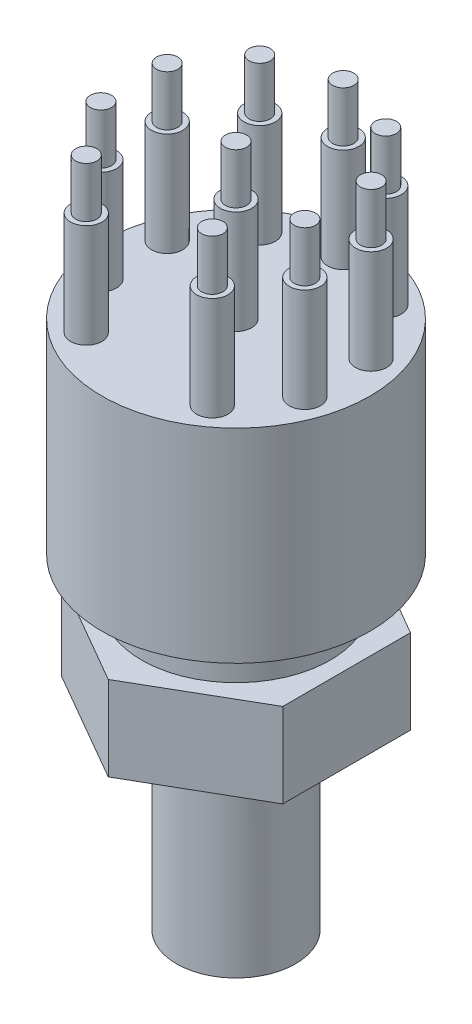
ISO-10303-21;
HEADER;
FILE_DESCRIPTION(('STEP AP214'),'2;1');
FILE_NAME('part.step','',(''),(''),'','','');
FILE_SCHEMA(('AUTOMOTIVE_DESIGN { 1 0 10303 214 1 1 1 1 }'));
ENDSEC;
DATA;
#1=APPLICATION_CONTEXT('core data for automotive mechanical design processes');
#2=APPLICATION_PROTOCOL_DEFINITION('international standard','automotive_design',2000,#1);
#3=PRODUCT_CONTEXT('',#1,'mechanical');
#4=PRODUCT('Part','Part','',(#3));
#5=PRODUCT_RELATED_PRODUCT_CATEGORY('part','',(#4));
#6=PRODUCT_DEFINITION_FORMATION('','',#4);
#7=PRODUCT_DEFINITION_CONTEXT('part definition',#1,'design');
#8=PRODUCT_DEFINITION('design','',#6,#7);
#9=PRODUCT_DEFINITION_SHAPE('','',#8);
#10=(LENGTH_UNIT() NAMED_UNIT(*) SI_UNIT(.MILLI.,.METRE.));
#11=(NAMED_UNIT(*) PLANE_ANGLE_UNIT() SI_UNIT($,.RADIAN.));
#12=(NAMED_UNIT(*) SI_UNIT($,.STERADIAN.) SOLID_ANGLE_UNIT());
#13=UNCERTAINTY_MEASURE_WITH_UNIT(LENGTH_MEASURE(1.E-05),#10,'distance_accuracy_value','');
#14=(GEOMETRIC_REPRESENTATION_CONTEXT(3) GLOBAL_UNCERTAINTY_ASSIGNED_CONTEXT((#13)) GLOBAL_UNIT_ASSIGNED_CONTEXT((#10,
#11,#12)) REPRESENTATION_CONTEXT('',''));
#15=CARTESIAN_POINT('',(0.,0.,0.));
#16=DIRECTION('',(0.,0.,1.));
#17=DIRECTION('',(1.,0.,0.));
#18=AXIS2_PLACEMENT_3D('',#15,#16,#17);
#19=CARTESIAN_POINT('',(-10.32,0.,-17.8747643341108));
#20=DIRECTION('',(0.,1.,0.));
#21=DIRECTION('',(0.,0.,1.));
#22=AXIS2_PLACEMENT_3D('',#19,#20,#21);
#23=PLANE('',#22);
#24=DIRECTION('',(-0.866025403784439,0.,-0.5));
#25=VECTOR('',#24,1.);
#26=CARTESIAN_POINT('',(10.32,0.,-5.95825477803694));
#27=LINE('',#26,#25);
#28=CARTESIAN_POINT('',(10.32,0.,-5.95825477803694));
#29=VERTEX_POINT('',#28);
#30=CARTESIAN_POINT('',(0.,0.,-11.9165095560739));
#31=VERTEX_POINT('',#30);
#32=EDGE_CURVE('E94',#29,#31,#27,.T.);
#33=ORIENTED_EDGE('',*,*,#32,.F.);
#34=DIRECTION('',(0.,0.,-1.));
#35=VECTOR('',#34,1.);
#36=CARTESIAN_POINT('',(10.32,0.,5.95825477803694));
#37=LINE('',#36,#35);
#38=CARTESIAN_POINT('',(10.32,0.,5.95825477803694));
#39=VERTEX_POINT('',#38);
#40=EDGE_CURVE('E124',#39,#29,#37,.T.);
#41=ORIENTED_EDGE('',*,*,#40,.F.);
#42=DIRECTION('',(0.866025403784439,0.,-0.5));
#43=VECTOR('',#42,1.);
#44=CARTESIAN_POINT('',(0.,0.,11.9165095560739));
#45=LINE('',#44,#43);
#46=CARTESIAN_POINT('',(0.,0.,11.9165095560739));
#47=VERTEX_POINT('',#46);
#48=EDGE_CURVE('E122',#47,#39,#45,.T.);
#49=ORIENTED_EDGE('',*,*,#48,.F.);
#50=DIRECTION('',(0.866025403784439,0.,0.5));
#51=VECTOR('',#50,1.);
#52=CARTESIAN_POINT('',(-10.32,0.,5.95825477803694));
#53=LINE('',#52,#51);
#54=CARTESIAN_POINT('',(-10.32,0.,5.95825477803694));
#55=VERTEX_POINT('',#54);
#56=EDGE_CURVE('E120',#55,#47,#53,.T.);
#57=ORIENTED_EDGE('',*,*,#56,.F.);
#58=DIRECTION('',(0.,0.,1.));
#59=VECTOR('',#58,1.);
#60=CARTESIAN_POINT('',(-10.32,0.,-5.95825477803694));
#61=LINE('',#60,#59);
#62=CARTESIAN_POINT('',(-10.32,0.,-5.95825477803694));
#63=VERTEX_POINT('',#62);
#64=EDGE_CURVE('E96',#63,#55,#61,.T.);
#65=ORIENTED_EDGE('',*,*,#64,.F.);
#66=DIRECTION('',(-0.866025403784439,0.,0.5));
#67=VECTOR('',#66,1.);
#68=CARTESIAN_POINT('',(0.,0.,-11.9165095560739));
#69=LINE('',#68,#67);
#70=EDGE_CURVE('E89',#31,#63,#69,.T.);
#71=ORIENTED_EDGE('',*,*,#70,.F.);
#72=EDGE_LOOP('',(#33,#41,#49,#57,#65,#71));
#73=FACE_BOUND('',#72,.T.);
#74=CARTESIAN_POINT('',(0.,0.,0.));
#75=DIRECTION('',(0.,1.,0.));
#76=DIRECTION('',(0.,0.,1.));
#77=AXIS2_PLACEMENT_3D('',#74,#75,#76);
#78=CIRCLE('',#77,8.73336420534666);
#79=CARTESIAN_POINT('',(0.,0.,8.73336420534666));
#80=VERTEX_POINT('',#79);
#81=EDGE_CURVE('E11',#80,#80,#78,.F.);
#82=ORIENTED_EDGE('',*,*,#81,.F.);
#83=EDGE_LOOP('',(#82));
#84=FACE_BOUND('',#83,.T.);
#85=ADVANCED_FACE('F36',(#73,#84),#23,.F.);
#86=CARTESIAN_POINT('',(0.,40.706,0.));
#87=DIRECTION('',(0.,1.,0.));
#88=DIRECTION('',(-1.,0.,0.));
#89=AXIS2_PLACEMENT_3D('',#86,#87,#88);
#90=PLANE('',#89);
#91=CARTESIAN_POINT('',(0.,40.706,0.));
#92=DIRECTION('',(0.,1.,0.));
#93=DIRECTION('',(-1.,0.,0.));
#94=AXIS2_PLACEMENT_3D('',#91,#92,#93);
#95=CIRCLE('',#94,1.4605);
#96=CARTESIAN_POINT('',(-1.46050000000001,40.706,0.));
#97=VERTEX_POINT('',#96);
#98=EDGE_CURVE('E472',#97,#97,#95,.T.);
#99=ORIENTED_EDGE('',*,*,#98,.T.);
#100=EDGE_LOOP('',(#99));
#101=FACE_BOUND('',#100,.T.);
#102=CARTESIAN_POINT('',(0.,40.706,0.));
#103=DIRECTION('',(0.,1.,0.));
#104=DIRECTION('',(-1.,0.,0.));
#105=AXIS2_PLACEMENT_3D('',#102,#103,#104);
#106=CIRCLE('',#105,0.9906);
#107=CARTESIAN_POINT('',(-0.990600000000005,40.706,0.));
#108=VERTEX_POINT('',#107);
#109=EDGE_CURVE('E480',#108,#108,#106,.T.);
#110=ORIENTED_EDGE('',*,*,#109,.F.);
#111=EDGE_LOOP('',(#110));
#112=FACE_BOUND('',#111,.T.);
#113=ADVANCED_FACE('F168',(#101,#112),#90,.T.);
#114=CARTESIAN_POINT('',(0.,31.054,0.));
#115=DIRECTION('',(0.,1.,0.));
#116=DIRECTION('',(-1.,0.,0.));
#117=AXIS2_PLACEMENT_3D('',#114,#115,#116);
#118=PLANE('',#117);
#119=CARTESIAN_POINT('',(-5.87785252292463,31.054,-8.09016994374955));
#120=DIRECTION('',(0.,1.,0.));
#121=DIRECTION('',(-0.809016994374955,0.,0.587785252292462));
#122=AXIS2_PLACEMENT_3D('',#119,#120,#121);
#123=CIRCLE('',#122,1.4605);
#124=CARTESIAN_POINT('',(-7.05942184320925,31.054,-7.23170958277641));
#125=VERTEX_POINT('',#124);
#126=EDGE_CURVE('E469',#125,#125,#123,.T.);
#127=ORIENTED_EDGE('',*,*,#126,.F.);
#128=EDGE_LOOP('',(#127));
#129=FACE_BOUND('',#128,.T.);
#130=CARTESIAN_POINT('',(-9.51056516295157,31.054,3.09016994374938));
#131=DIRECTION('',(0.,1.,0.));
#132=DIRECTION('',(0.309016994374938,0.,0.951056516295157));
#133=AXIS2_PLACEMENT_3D('',#130,#131,#132);
#134=CIRCLE('',#133,1.4605);
#135=CARTESIAN_POINT('',(-9.05924584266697,31.054,4.47918798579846));
#136=VERTEX_POINT('',#135);
#137=EDGE_CURVE('E445',#136,#136,#134,.T.);
#138=ORIENTED_EDGE('',*,*,#137,.F.);
#139=EDGE_LOOP('',(#138));
#140=FACE_BOUND('',#139,.T.);
#141=CARTESIAN_POINT('',(5.87785252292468,31.054,8.09016994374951));
#142=DIRECTION('',(0.,1.,0.));
#143=DIRECTION('',(0.809016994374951,0.,-0.587785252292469));
#144=AXIS2_PLACEMENT_3D('',#141,#142,#143);
#145=CIRCLE('',#144,1.4605);
#146=CARTESIAN_POINT('',(7.0594218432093,31.054,7.23170958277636));
#147=VERTEX_POINT('',#146);
#148=EDGE_CURVE('E421',#147,#147,#145,.T.);
#149=ORIENTED_EDGE('',*,*,#148,.F.);
#150=EDGE_LOOP('',(#149));
#151=FACE_BOUND('',#150,.T.);
#152=CARTESIAN_POINT('',(9.51056516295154,31.054,-3.09016994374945));
#153=DIRECTION('',(0.,1.,0.));
#154=DIRECTION('',(-0.309016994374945,0.,-0.951056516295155));
#155=AXIS2_PLACEMENT_3D('',#152,#153,#154);
#156=CIRCLE('',#155,1.4605);
#157=CARTESIAN_POINT('',(9.05924584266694,31.054,-4.47918798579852));
#158=VERTEX_POINT('',#157);
#159=EDGE_CURVE('E397',#158,#158,#156,.T.);
#160=ORIENTED_EDGE('',*,*,#159,.F.);
#161=EDGE_LOOP('',(#160));
#162=FACE_BOUND('',#161,.T.);
#163=CARTESIAN_POINT('',(0.,31.054,-10.));
#164=DIRECTION('',(0.,1.,0.));
#165=DIRECTION('',(-1.,0.,0.));
#166=AXIS2_PLACEMENT_3D('',#163,#164,#165);
#167=CIRCLE('',#166,1.4605);
#168=CARTESIAN_POINT('',(-1.4605,31.054,-10.));
#169=VERTEX_POINT('',#168);
#170=EDGE_CURVE('E367',#169,#169,#167,.T.);
#171=ORIENTED_EDGE('',*,*,#170,.F.);
#172=EDGE_LOOP('',(#171));
#173=FACE_BOUND('',#172,.T.);
#174=CARTESIAN_POINT('',(0.,31.054,0.));
#175=DIRECTION('',(0.,1.,0.));
#176=DIRECTION('',(-1.,0.,0.));
#177=AXIS2_PLACEMENT_3D('',#174,#175,#176);
#178=CIRCLE('',#177,12.5);
#179=CARTESIAN_POINT('',(-12.5,31.054,0.));
#180=VERTEX_POINT('',#179);
#181=EDGE_CURVE('E357',#180,#180,#178,.T.);
#182=ORIENTED_EDGE('',*,*,#181,.T.);
#183=EDGE_LOOP('',(#182));
#184=FACE_BOUND('',#183,.T.);
#185=CARTESIAN_POINT('',(5.87785252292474,31.054,-8.09016994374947));
#186=DIRECTION('',(0.,1.,0.));
#187=DIRECTION('',(-0.809016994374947,0.,-0.587785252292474));
#188=AXIS2_PLACEMENT_3D('',#185,#186,#187);
#189=CIRCLE('',#188,1.4605);
#190=CARTESIAN_POINT('',(4.69628320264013,31.054,-8.94863030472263));
#191=VERTEX_POINT('',#190);
#192=EDGE_CURVE('E385',#191,#191,#189,.T.);
#193=ORIENTED_EDGE('',*,*,#192,.F.);
#194=EDGE_LOOP('',(#193));
#195=FACE_BOUND('',#194,.T.);
#196=CARTESIAN_POINT('',(9.51056516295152,31.054,3.09016994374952));
#197=DIRECTION('',(0.,1.,0.));
#198=DIRECTION('',(0.309016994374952,0.,-0.951056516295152));
#199=AXIS2_PLACEMENT_3D('',#196,#197,#198);
#200=CIRCLE('',#199,1.4605);
#201=CARTESIAN_POINT('',(9.96188448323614,31.054,1.70115190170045));
#202=VERTEX_POINT('',#201);
#203=EDGE_CURVE('E409',#202,#202,#200,.T.);
#204=ORIENTED_EDGE('',*,*,#203,.F.);
#205=EDGE_LOOP('',(#204));
#206=FACE_BOUND('',#205,.T.);
#207=CARTESIAN_POINT('',(-5.87785252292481,31.054,8.09016994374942));
#208=DIRECTION('',(0.,1.,0.));
#209=DIRECTION('',(0.809016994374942,0.,0.58778525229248));
#210=AXIS2_PLACEMENT_3D('',#207,#208,#209);
#211=CIRCLE('',#210,1.4605);
#212=CARTESIAN_POINT('',(-4.6962832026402,31.054,8.94863030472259));
#213=VERTEX_POINT('',#212);
#214=EDGE_CURVE('E433',#213,#213,#211,.T.);
#215=ORIENTED_EDGE('',*,*,#214,.F.);
#216=EDGE_LOOP('',(#215));
#217=FACE_BOUND('',#216,.T.);
#218=CARTESIAN_POINT('',(-9.5105651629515,31.054,-3.09016994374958));
#219=DIRECTION('',(0.,1.,0.));
#220=DIRECTION('',(-0.309016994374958,0.,0.95105651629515));
#221=AXIS2_PLACEMENT_3D('',#218,#219,#220);
#222=CIRCLE('',#221,1.4605);
#223=CARTESIAN_POINT('',(-9.96188448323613,31.054,-1.70115190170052));
#224=VERTEX_POINT('',#223);
#225=EDGE_CURVE('E457',#224,#224,#222,.T.);
#226=ORIENTED_EDGE('',*,*,#225,.F.);
#227=EDGE_LOOP('',(#226));
#228=FACE_BOUND('',#227,.T.);
#229=CARTESIAN_POINT('',(0.,31.054,0.));
#230=DIRECTION('',(0.,1.,0.));
#231=DIRECTION('',(-1.,0.,0.));
#232=AXIS2_PLACEMENT_3D('',#229,#230,#231);
#233=CIRCLE('',#232,1.4605);
#234=CARTESIAN_POINT('',(-1.4605,31.054,0.));
#235=VERTEX_POINT('',#234);
#236=EDGE_CURVE('E474',#235,#235,#233,.T.);
#237=ORIENTED_EDGE('',*,*,#236,.F.);
#238=EDGE_LOOP('',(#237));
#239=FACE_BOUND('',#238,.T.);
#240=ADVANCED_FACE('F172',(#129,#140,#151,#162,#173,#184,#195,#206,#217,#228,#239),#118,.T.);
#241=CARTESIAN_POINT('',(0.,40.706,-10.));
#242=DIRECTION('',(0.,1.,0.));
#243=DIRECTION('',(-1.,0.,0.));
#244=AXIS2_PLACEMENT_3D('',#241,#242,#243);
#245=PLANE('',#244);
#246=CARTESIAN_POINT('',(0.,40.706,-10.));
#247=DIRECTION('',(0.,1.,0.));
#248=DIRECTION('',(-1.,0.,0.));
#249=AXIS2_PLACEMENT_3D('',#246,#247,#248);
#250=CIRCLE('',#249,1.4605);
#251=CARTESIAN_POINT('',(-1.46050000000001,40.706,-10.));
#252=VERTEX_POINT('',#251);
#253=EDGE_CURVE('E364',#252,#252,#250,.T.);
#254=ORIENTED_EDGE('',*,*,#253,.T.);
#255=EDGE_LOOP('',(#254));
#256=FACE_BOUND('',#255,.T.);
#257=CARTESIAN_POINT('',(0.,40.706,-10.));
#258=DIRECTION('',(0.,1.,0.));
#259=DIRECTION('',(-1.,0.,0.));
#260=AXIS2_PLACEMENT_3D('',#257,#258,#259);
#261=CIRCLE('',#260,0.9906);
#262=CARTESIAN_POINT('',(-0.990600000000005,40.706,-10.));
#263=VERTEX_POINT('',#262);
#264=EDGE_CURVE('E373',#263,#263,#261,.T.);
#265=ORIENTED_EDGE('',*,*,#264,.F.);
#266=EDGE_LOOP('',(#265));
#267=FACE_BOUND('',#266,.T.);
#268=ADVANCED_FACE('F178',(#256,#267),#245,.T.);
#269=CARTESIAN_POINT('',(-10.32,7.874,-17.8747643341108));
#270=DIRECTION('',(0.,1.,0.));
#271=DIRECTION('',(0.,0.,1.));
#272=AXIS2_PLACEMENT_3D('',#269,#270,#271);
#273=PLANE('',#272);
#274=DIRECTION('',(-0.866025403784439,0.,-0.5));
#275=VECTOR('',#274,1.);
#276=CARTESIAN_POINT('',(10.32,7.874,-5.95825477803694));
#277=LINE('',#276,#275);
#278=CARTESIAN_POINT('',(10.32,7.874,-5.95825477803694));
#279=VERTEX_POINT('',#278);
#280=CARTESIAN_POINT('',(0.,7.874,-11.9165095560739));
#281=VERTEX_POINT('',#280);
#282=EDGE_CURVE('E126',#279,#281,#277,.T.);
#283=ORIENTED_EDGE('',*,*,#282,.T.);
#284=DIRECTION('',(-0.866025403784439,0.,0.5));
#285=VECTOR('',#284,1.);
#286=CARTESIAN_POINT('',(0.,7.874,-11.9165095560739));
#287=LINE('',#286,#285);
#288=CARTESIAN_POINT('',(-10.32,7.874,-5.95825477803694));
#289=VERTEX_POINT('',#288);
#290=EDGE_CURVE('E104',#281,#289,#287,.T.);
#291=ORIENTED_EDGE('',*,*,#290,.T.);
#292=DIRECTION('',(0.,0.,1.));
#293=VECTOR('',#292,1.);
#294=CARTESIAN_POINT('',(-10.32,7.874,-5.95825477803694));
#295=LINE('',#294,#293);
#296=CARTESIAN_POINT('',(-10.32,7.874,5.95825477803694));
#297=VERTEX_POINT('',#296);
#298=EDGE_CURVE('E129',#289,#297,#295,.T.);
#299=ORIENTED_EDGE('',*,*,#298,.T.);
#300=DIRECTION('',(0.866025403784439,0.,0.5));
#301=VECTOR('',#300,1.);
#302=CARTESIAN_POINT('',(-10.32,7.874,5.95825477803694));
#303=LINE('',#302,#301);
#304=CARTESIAN_POINT('',(0.,7.874,11.9165095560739));
#305=VERTEX_POINT('',#304);
#306=EDGE_CURVE('E131',#297,#305,#303,.T.);
#307=ORIENTED_EDGE('',*,*,#306,.T.);
#308=DIRECTION('',(0.866025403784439,0.,-0.5));
#309=VECTOR('',#308,1.);
#310=CARTESIAN_POINT('',(0.,7.874,11.9165095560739));
#311=LINE('',#310,#309);
#312=CARTESIAN_POINT('',(10.32,7.874,5.95825477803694));
#313=VERTEX_POINT('',#312);
#314=EDGE_CURVE('E56',#305,#313,#311,.T.);
#315=ORIENTED_EDGE('',*,*,#314,.T.);
#316=DIRECTION('',(0.,0.,-1.));
#317=VECTOR('',#316,1.);
#318=CARTESIAN_POINT('',(10.32,7.874,5.95825477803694));
#319=LINE('',#318,#317);
#320=EDGE_CURVE('E51',#313,#279,#319,.T.);
#321=ORIENTED_EDGE('',*,*,#320,.T.);
#322=EDGE_LOOP('',(#283,#291,#299,#307,#315,#321));
#323=FACE_BOUND('',#322,.T.);
#324=CARTESIAN_POINT('',(0.,7.874,0.));
#325=DIRECTION('',(0.,1.,0.));
#326=DIRECTION('',(-1.,0.,0.));
#327=AXIS2_PLACEMENT_3D('',#324,#325,#326);
#328=CIRCLE('',#327,8.8011);
#329=CARTESIAN_POINT('',(-8.8011,7.874,0.));
#330=VERTEX_POINT('',#329);
#331=EDGE_CURVE('E115',#330,#330,#328,.T.);
#332=ORIENTED_EDGE('',*,*,#331,.F.);
#333=EDGE_LOOP('',(#332));
#334=FACE_BOUND('',#333,.T.);
#335=ADVANCED_FACE('F330',(#323,#334),#273,.T.);
#336=CARTESIAN_POINT('',(10.32,7.874,-5.95825477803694));
#337=DIRECTION('',(-0.5,0.,0.866025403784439));
#338=DIRECTION('',(0.866025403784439,0.,0.5));
#339=AXIS2_PLACEMENT_3D('',#336,#337,#338);
#340=PLANE('',#339);
#341=ORIENTED_EDGE('',*,*,#32,.T.);
#342=DIRECTION('',(0.,-1.,0.));
#343=VECTOR('',#342,1.);
#344=CARTESIAN_POINT('',(0.,7.874,-11.9165095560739));
#345=LINE('',#344,#343);
#346=EDGE_CURVE('E102',#281,#31,#345,.T.);
#347=ORIENTED_EDGE('',*,*,#346,.F.);
#348=ORIENTED_EDGE('',*,*,#282,.F.);
#349=DIRECTION('',(0.,-1.,0.));
#350=VECTOR('',#349,1.);
#351=CARTESIAN_POINT('',(10.32,7.874,-5.95825477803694));
#352=LINE('',#351,#350);
#353=EDGE_CURVE('E111',#279,#29,#352,.T.);
#354=ORIENTED_EDGE('',*,*,#353,.T.);
#355=EDGE_LOOP('',(#341,#347,#348,#354));
#356=FACE_BOUND('',#355,.T.);
#357=ADVANCED_FACE('F38',(#356),#340,.F.);
#358=CARTESIAN_POINT('',(0.,7.874,-11.9165095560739));
#359=DIRECTION('',(0.5,0.,0.866025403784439));
#360=DIRECTION('',(0.866025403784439,0.,-0.5));
#361=AXIS2_PLACEMENT_3D('',#358,#359,#360);
#362=PLANE('',#361);
#363=ORIENTED_EDGE('',*,*,#70,.T.);
#364=DIRECTION('',(0.,-1.,0.));
#365=VECTOR('',#364,1.);
#366=CARTESIAN_POINT('',(-10.32,7.874,-5.95825477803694));
#367=LINE('',#366,#365);
#368=EDGE_CURVE('E108',#289,#63,#367,.T.);
#369=ORIENTED_EDGE('',*,*,#368,.F.);
#370=ORIENTED_EDGE('',*,*,#290,.F.);
#371=ORIENTED_EDGE('',*,*,#346,.T.);
#372=EDGE_LOOP('',(#363,#369,#370,#371));
#373=FACE_BOUND('',#372,.T.);
#374=ADVANCED_FACE('F103',(#373),#362,.F.);
#375=CARTESIAN_POINT('',(-10.32,7.874,-5.95825477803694));
#376=DIRECTION('',(1.,0.,0.));
#377=DIRECTION('',(0.,0.,-1.));
#378=AXIS2_PLACEMENT_3D('',#375,#376,#377);
#379=PLANE('',#378);
#380=ORIENTED_EDGE('',*,*,#64,.T.);
#381=DIRECTION('',(0.,-1.,0.));
#382=VECTOR('',#381,1.);
#383=CARTESIAN_POINT('',(-10.32,7.874,5.95825477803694));
#384=LINE('',#383,#382);
#385=EDGE_CURVE('E142',#297,#55,#384,.T.);
#386=ORIENTED_EDGE('',*,*,#385,.F.);
#387=ORIENTED_EDGE('',*,*,#298,.F.);
#388=ORIENTED_EDGE('',*,*,#368,.T.);
#389=EDGE_LOOP('',(#380,#386,#387,#388));
#390=FACE_BOUND('',#389,.T.);
#391=ADVANCED_FACE('F698',(#390),#379,.F.);
#392=CARTESIAN_POINT('',(-10.32,7.874,5.95825477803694));
#393=DIRECTION('',(0.5,0.,-0.866025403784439));
#394=DIRECTION('',(-0.866025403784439,0.,-0.5));
#395=AXIS2_PLACEMENT_3D('',#392,#393,#394);
#396=PLANE('',#395);
#397=ORIENTED_EDGE('',*,*,#56,.T.);
#398=DIRECTION('',(0.,-1.,0.));
#399=VECTOR('',#398,1.);
#400=CARTESIAN_POINT('',(0.,7.874,11.9165095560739));
#401=LINE('',#400,#399);
#402=EDGE_CURVE('E139',#305,#47,#401,.T.);
#403=ORIENTED_EDGE('',*,*,#402,.F.);
#404=ORIENTED_EDGE('',*,*,#306,.F.);
#405=ORIENTED_EDGE('',*,*,#385,.T.);
#406=EDGE_LOOP('',(#397,#403,#404,#405));
#407=FACE_BOUND('',#406,.T.);
#408=ADVANCED_FACE('F688',(#407),#396,.F.);
#409=CARTESIAN_POINT('',(0.,7.874,11.9165095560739));
#410=DIRECTION('',(-0.5,0.,-0.866025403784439));
#411=DIRECTION('',(-0.866025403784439,0.,0.5));
#412=AXIS2_PLACEMENT_3D('',#409,#410,#411);
#413=PLANE('',#412);
#414=ORIENTED_EDGE('',*,*,#48,.T.);
#415=DIRECTION('',(0.,-1.,0.));
#416=VECTOR('',#415,1.);
#417=CARTESIAN_POINT('',(10.32,7.874,5.95825477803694));
#418=LINE('',#417,#416);
#419=EDGE_CURVE('E136',#313,#39,#418,.T.);
#420=ORIENTED_EDGE('',*,*,#419,.F.);
#421=ORIENTED_EDGE('',*,*,#314,.F.);
#422=ORIENTED_EDGE('',*,*,#402,.T.);
#423=EDGE_LOOP('',(#414,#420,#421,#422));
#424=FACE_BOUND('',#423,.T.);
#425=ADVANCED_FACE('F349',(#424),#413,.F.);
#426=CARTESIAN_POINT('',(10.32,7.874,5.95825477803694));
#427=DIRECTION('',(-1.,0.,0.));
#428=DIRECTION('',(0.,0.,1.));
#429=AXIS2_PLACEMENT_3D('',#426,#427,#428);
#430=PLANE('',#429);
#431=ORIENTED_EDGE('',*,*,#40,.T.);
#432=ORIENTED_EDGE('',*,*,#353,.F.);
#433=ORIENTED_EDGE('',*,*,#320,.F.);
#434=ORIENTED_EDGE('',*,*,#419,.T.);
#435=EDGE_LOOP('',(#431,#432,#433,#434));
#436=FACE_BOUND('',#435,.T.);
#437=ADVANCED_FACE('F344',(#436),#430,.F.);
#438=CARTESIAN_POINT('',(0.,0.,0.));
#439=DIRECTION('',(0.,1.,0.));
#440=DIRECTION('',(-1.,0.,0.));
#441=AXIS2_PLACEMENT_3D('',#438,#439,#440);
#442=CYLINDRICAL_SURFACE('',#441,8.8011);
#443=CARTESIAN_POINT('',(0.,12.054,0.));
#444=DIRECTION('',(0.,1.,0.));
#445=DIRECTION('',(-1.,0.,0.));
#446=AXIS2_PLACEMENT_3D('',#443,#444,#445);
#447=CIRCLE('',#446,8.8011);
#448=CARTESIAN_POINT('',(-8.8011,12.054,0.));
#449=VERTEX_POINT('',#448);
#450=EDGE_CURVE('E112',#449,#449,#447,.T.);
#451=ORIENTED_EDGE('',*,*,#450,.F.);
#452=EDGE_LOOP('',(#451));
#453=FACE_BOUND('',#452,.T.);
#454=ORIENTED_EDGE('',*,*,#331,.T.);
#455=EDGE_LOOP('',(#454));
#456=FACE_BOUND('',#455,.T.);
#457=ADVANCED_FACE('F338',(#453,#456),#442,.T.);
#458=CARTESIAN_POINT('',(0.,12.054,0.));
#459=DIRECTION('',(0.,1.,0.));
#460=DIRECTION('',(-1.,0.,0.));
#461=AXIS2_PLACEMENT_3D('',#458,#459,#460);
#462=PLANE('',#461);
#463=CARTESIAN_POINT('',(0.,12.054,0.));
#464=DIRECTION('',(0.,1.,0.));
#465=DIRECTION('',(-1.,0.,0.));
#466=AXIS2_PLACEMENT_3D('',#463,#464,#465);
#467=CIRCLE('',#466,12.5);
#468=CARTESIAN_POINT('',(-12.5,12.054,0.));
#469=VERTEX_POINT('',#468);
#470=EDGE_CURVE('E359',#469,#469,#467,.T.);
#471=ORIENTED_EDGE('',*,*,#470,.F.);
#472=EDGE_LOOP('',(#471));
#473=FACE_BOUND('',#472,.T.);
#474=ORIENTED_EDGE('',*,*,#450,.T.);
#475=EDGE_LOOP('',(#474));
#476=FACE_BOUND('',#475,.T.);
#477=ADVANCED_FACE('F336',(#473,#476),#462,.F.);
#478=CARTESIAN_POINT('',(0.,31.054,0.));
#479=DIRECTION('',(0.,-1.,0.));
#480=DIRECTION('',(1.,0.,0.));
#481=AXIS2_PLACEMENT_3D('',#478,#479,#480);
#482=CYLINDRICAL_SURFACE('',#481,12.5);
#483=ORIENTED_EDGE('',*,*,#181,.F.);
#484=EDGE_LOOP('',(#483));
#485=FACE_BOUND('',#484,.T.);
#486=ORIENTED_EDGE('',*,*,#470,.T.);
#487=EDGE_LOOP('',(#486));
#488=FACE_BOUND('',#487,.T.);
#489=ADVANCED_FACE('F334',(#485,#488),#482,.T.);
#490=CARTESIAN_POINT('',(0.,40.706,-10.));
#491=DIRECTION('',(0.,-1.,0.));
#492=DIRECTION('',(1.,0.,0.));
#493=AXIS2_PLACEMENT_3D('',#490,#491,#492);
#494=CYLINDRICAL_SURFACE('',#493,1.4605);
#495=ORIENTED_EDGE('',*,*,#253,.F.);
#496=EDGE_LOOP('',(#495));
#497=FACE_BOUND('',#496,.T.);
#498=ORIENTED_EDGE('',*,*,#170,.T.);
#499=EDGE_LOOP('',(#498));
#500=FACE_BOUND('',#499,.T.);
#501=ADVANCED_FACE('F326',(#497,#500),#494,.T.);
#502=CARTESIAN_POINT('',(0.,45.405,-10.));
#503=DIRECTION('',(0.,-1.,0.));
#504=DIRECTION('',(1.,0.,0.));
#505=AXIS2_PLACEMENT_3D('',#502,#503,#504);
#506=CYLINDRICAL_SURFACE('',#505,0.9906);
#507=CARTESIAN_POINT('',(0.,45.405,-10.));
#508=DIRECTION('',(0.,1.,0.));
#509=DIRECTION('',(-1.,0.,0.));
#510=AXIS2_PLACEMENT_3D('',#507,#508,#509);
#511=CIRCLE('',#510,0.9906);
#512=CARTESIAN_POINT('',(-0.990600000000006,45.405,-10.));
#513=VERTEX_POINT('',#512);
#514=EDGE_CURVE('E370',#513,#513,#511,.T.);
#515=ORIENTED_EDGE('',*,*,#514,.F.);
#516=EDGE_LOOP('',(#515));
#517=FACE_BOUND('',#516,.T.);
#518=ORIENTED_EDGE('',*,*,#264,.T.);
#519=EDGE_LOOP('',(#518));
#520=FACE_BOUND('',#519,.T.);
#521=ADVANCED_FACE('F322',(#517,#520),#506,.T.);
#522=CARTESIAN_POINT('',(0.,45.405,-10.));
#523=DIRECTION('',(0.,1.,0.));
#524=DIRECTION('',(-1.,0.,0.));
#525=AXIS2_PLACEMENT_3D('',#522,#523,#524);
#526=PLANE('',#525);
#527=ORIENTED_EDGE('',*,*,#514,.T.);
#528=EDGE_LOOP('',(#527));
#529=FACE_BOUND('',#528,.T.);
#530=ADVANCED_FACE('F309',(#529),#526,.T.);
#531=CARTESIAN_POINT('',(5.87785252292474,40.706,-8.09016994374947));
#532=DIRECTION('',(0.,-1.,0.));
#533=DIRECTION('',(0.809016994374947,0.,0.587785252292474));
#534=AXIS2_PLACEMENT_3D('',#531,#532,#533);
#535=CYLINDRICAL_SURFACE('',#534,1.4605);
#536=CARTESIAN_POINT('',(5.87785252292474,40.706,-8.09016994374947));
#537=DIRECTION('',(0.,1.,0.));
#538=DIRECTION('',(-0.809016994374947,0.,-0.587785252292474));
#539=AXIS2_PLACEMENT_3D('',#536,#537,#538);
#540=CIRCLE('',#539,1.4605);
#541=CARTESIAN_POINT('',(4.69628320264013,40.706,-8.94863030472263));
#542=VERTEX_POINT('',#541);
#543=EDGE_CURVE('E376',#542,#542,#540,.T.);
#544=ORIENTED_EDGE('',*,*,#543,.F.);
#545=EDGE_LOOP('',(#544));
#546=FACE_BOUND('',#545,.T.);
#547=ORIENTED_EDGE('',*,*,#192,.T.);
#548=EDGE_LOOP('',(#547));
#549=FACE_BOUND('',#548,.T.);
#550=ADVANCED_FACE('F293',(#546,#549),#535,.T.);
#551=CARTESIAN_POINT('',(5.87785252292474,40.706,-8.09016994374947));
#552=DIRECTION('',(0.,1.,0.));
#553=DIRECTION('',(-0.809016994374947,0.,-0.587785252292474));
#554=AXIS2_PLACEMENT_3D('',#551,#552,#553);
#555=PLANE('',#554);
#556=ORIENTED_EDGE('',*,*,#543,.T.);
#557=EDGE_LOOP('',(#556));
#558=FACE_BOUND('',#557,.T.);
#559=CARTESIAN_POINT('',(5.87785252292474,40.706,-8.09016994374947));
#560=DIRECTION('',(0.,1.,0.));
#561=DIRECTION('',(-0.809016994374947,0.,-0.587785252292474));
#562=AXIS2_PLACEMENT_3D('',#559,#560,#561);
#563=CIRCLE('',#562,0.9906);
#564=CARTESIAN_POINT('',(5.07644028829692,40.706,-8.67243001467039));
#565=VERTEX_POINT('',#564);
#566=EDGE_CURVE('E379',#565,#565,#563,.T.);
#567=ORIENTED_EDGE('',*,*,#566,.F.);
#568=EDGE_LOOP('',(#567));
#569=FACE_BOUND('',#568,.T.);
#570=ADVANCED_FACE('F312',(#558,#569),#555,.T.);
#571=CARTESIAN_POINT('',(5.87785252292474,45.405,-8.09016994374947));
#572=DIRECTION('',(0.,-1.,0.));
#573=DIRECTION('',(0.809016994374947,0.,0.587785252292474));
#574=AXIS2_PLACEMENT_3D('',#571,#572,#573);
#575=CYLINDRICAL_SURFACE('',#574,0.9906);
#576=CARTESIAN_POINT('',(5.87785252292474,45.405,-8.09016994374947));
#577=DIRECTION('',(0.,1.,0.));
#578=DIRECTION('',(-0.809016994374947,0.,-0.587785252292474));
#579=AXIS2_PLACEMENT_3D('',#576,#577,#578);
#580=CIRCLE('',#579,0.9906);
#581=CARTESIAN_POINT('',(5.07644028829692,45.405,-8.67243001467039));
#582=VERTEX_POINT('',#581);
#583=EDGE_CURVE('E382',#582,#582,#580,.T.);
#584=ORIENTED_EDGE('',*,*,#583,.F.);
#585=EDGE_LOOP('',(#584));
#586=FACE_BOUND('',#585,.T.);
#587=ORIENTED_EDGE('',*,*,#566,.T.);
#588=EDGE_LOOP('',(#587));
#589=FACE_BOUND('',#588,.T.);
#590=ADVANCED_FACE('F307',(#586,#589),#575,.T.);
#591=CARTESIAN_POINT('',(5.87785252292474,45.405,-8.09016994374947));
#592=DIRECTION('',(0.,1.,0.));
#593=DIRECTION('',(-0.809016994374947,0.,-0.587785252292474));
#594=AXIS2_PLACEMENT_3D('',#591,#592,#593);
#595=PLANE('',#594);
#596=ORIENTED_EDGE('',*,*,#583,.T.);
#597=EDGE_LOOP('',(#596));
#598=FACE_BOUND('',#597,.T.);
#599=ADVANCED_FACE('F303',(#598),#595,.T.);
#600=CARTESIAN_POINT('',(9.51056516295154,40.706,-3.09016994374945));
#601=DIRECTION('',(0.,-1.,0.));
#602=DIRECTION('',(0.309016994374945,0.,0.951056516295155));
#603=AXIS2_PLACEMENT_3D('',#600,#601,#602);
#604=CYLINDRICAL_SURFACE('',#603,1.4605);
#605=CARTESIAN_POINT('',(9.51056516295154,40.706,-3.09016994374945));
#606=DIRECTION('',(0.,1.,0.));
#607=DIRECTION('',(-0.309016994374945,0.,-0.951056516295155));
#608=AXIS2_PLACEMENT_3D('',#605,#606,#607);
#609=CIRCLE('',#608,1.4605);
#610=CARTESIAN_POINT('',(9.05924584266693,40.706,-4.47918798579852));
#611=VERTEX_POINT('',#610);
#612=EDGE_CURVE('E388',#611,#611,#609,.T.);
#613=ORIENTED_EDGE('',*,*,#612,.F.);
#614=EDGE_LOOP('',(#613));
#615=FACE_BOUND('',#614,.T.);
#616=ORIENTED_EDGE('',*,*,#159,.T.);
#617=EDGE_LOOP('',(#616));
#618=FACE_BOUND('',#617,.T.);
#619=ADVANCED_FACE('F277',(#615,#618),#604,.T.);
#620=CARTESIAN_POINT('',(9.51056516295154,40.706,-3.09016994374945));
#621=DIRECTION('',(0.,1.,0.));
#622=DIRECTION('',(-0.309016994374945,0.,-0.951056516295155));
#623=AXIS2_PLACEMENT_3D('',#620,#621,#622);
#624=PLANE('',#623);
#625=ORIENTED_EDGE('',*,*,#612,.T.);
#626=EDGE_LOOP('',(#625));
#627=FACE_BOUND('',#626,.T.);
#628=CARTESIAN_POINT('',(9.51056516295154,40.706,-3.09016994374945));
#629=DIRECTION('',(0.,1.,0.));
#630=DIRECTION('',(-0.309016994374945,0.,-0.951056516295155));
#631=AXIS2_PLACEMENT_3D('',#628,#629,#630);
#632=CIRCLE('',#631,0.9906);
#633=CARTESIAN_POINT('',(9.20445292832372,40.706,-4.03228652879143));
#634=VERTEX_POINT('',#633);
#635=EDGE_CURVE('E391',#634,#634,#632,.T.);
#636=ORIENTED_EDGE('',*,*,#635,.F.);
#637=EDGE_LOOP('',(#636));
#638=FACE_BOUND('',#637,.T.);
#639=ADVANCED_FACE('F296',(#627,#638),#624,.T.);
#640=CARTESIAN_POINT('',(9.51056516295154,45.405,-3.09016994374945));
#641=DIRECTION('',(0.,-1.,0.));
#642=DIRECTION('',(0.309016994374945,0.,0.951056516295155));
#643=AXIS2_PLACEMENT_3D('',#640,#641,#642);
#644=CYLINDRICAL_SURFACE('',#643,0.9906);
#645=CARTESIAN_POINT('',(9.51056516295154,45.405,-3.09016994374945));
#646=DIRECTION('',(0.,1.,0.));
#647=DIRECTION('',(-0.309016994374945,0.,-0.951056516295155));
#648=AXIS2_PLACEMENT_3D('',#645,#646,#647);
#649=CIRCLE('',#648,0.9906);
#650=CARTESIAN_POINT('',(9.20445292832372,45.405,-4.03228652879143));
#651=VERTEX_POINT('',#650);
#652=EDGE_CURVE('E394',#651,#651,#649,.T.);
#653=ORIENTED_EDGE('',*,*,#652,.F.);
#654=EDGE_LOOP('',(#653));
#655=FACE_BOUND('',#654,.T.);
#656=ORIENTED_EDGE('',*,*,#635,.T.);
#657=EDGE_LOOP('',(#656));
#658=FACE_BOUND('',#657,.T.);
#659=ADVANCED_FACE('F291',(#655,#658),#644,.T.);
#660=CARTESIAN_POINT('',(9.51056516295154,45.405,-3.09016994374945));
#661=DIRECTION('',(0.,1.,0.));
#662=DIRECTION('',(-0.309016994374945,0.,-0.951056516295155));
#663=AXIS2_PLACEMENT_3D('',#660,#661,#662);
#664=PLANE('',#663);
#665=ORIENTED_EDGE('',*,*,#652,.T.);
#666=EDGE_LOOP('',(#665));
#667=FACE_BOUND('',#666,.T.);
#668=ADVANCED_FACE('F287',(#667),#664,.T.);
#669=CARTESIAN_POINT('',(9.51056516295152,40.706,3.09016994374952));
#670=DIRECTION('',(0.,-1.,0.));
#671=DIRECTION('',(-0.309016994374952,0.,0.951056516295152));
#672=AXIS2_PLACEMENT_3D('',#669,#670,#671);
#673=CYLINDRICAL_SURFACE('',#672,1.4605);
#674=CARTESIAN_POINT('',(9.51056516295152,40.706,3.09016994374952));
#675=DIRECTION('',(0.,1.,0.));
#676=DIRECTION('',(0.309016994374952,0.,-0.951056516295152));
#677=AXIS2_PLACEMENT_3D('',#674,#675,#676);
#678=CIRCLE('',#677,1.4605);
#679=CARTESIAN_POINT('',(9.96188448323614,40.706,1.70115190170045));
#680=VERTEX_POINT('',#679);
#681=EDGE_CURVE('E400',#680,#680,#678,.T.);
#682=ORIENTED_EDGE('',*,*,#681,.F.);
#683=EDGE_LOOP('',(#682));
#684=FACE_BOUND('',#683,.T.);
#685=ORIENTED_EDGE('',*,*,#203,.T.);
#686=EDGE_LOOP('',(#685));
#687=FACE_BOUND('',#686,.T.);
#688=ADVANCED_FACE('F261',(#684,#687),#673,.T.);
#689=CARTESIAN_POINT('',(9.51056516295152,40.706,3.09016994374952));
#690=DIRECTION('',(0.,1.,0.));
#691=DIRECTION('',(0.309016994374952,0.,-0.951056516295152));
#692=AXIS2_PLACEMENT_3D('',#689,#690,#691);
#693=PLANE('',#692);
#694=ORIENTED_EDGE('',*,*,#681,.T.);
#695=EDGE_LOOP('',(#694));
#696=FACE_BOUND('',#695,.T.);
#697=CARTESIAN_POINT('',(9.51056516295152,40.706,3.09016994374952));
#698=DIRECTION('',(0.,1.,0.));
#699=DIRECTION('',(0.309016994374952,0.,-0.951056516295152));
#700=AXIS2_PLACEMENT_3D('',#697,#698,#699);
#701=CIRCLE('',#700,0.9906);
#702=CARTESIAN_POINT('',(9.81667739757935,40.706,2.14805335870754));
#703=VERTEX_POINT('',#702);
#704=EDGE_CURVE('E403',#703,#703,#701,.T.);
#705=ORIENTED_EDGE('',*,*,#704,.F.);
#706=EDGE_LOOP('',(#705));
#707=FACE_BOUND('',#706,.T.);
#708=ADVANCED_FACE('F280',(#696,#707),#693,.T.);
#709=CARTESIAN_POINT('',(9.51056516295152,45.405,3.09016994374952));
#710=DIRECTION('',(0.,-1.,0.));
#711=DIRECTION('',(-0.309016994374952,0.,0.951056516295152));
#712=AXIS2_PLACEMENT_3D('',#709,#710,#711);
#713=CYLINDRICAL_SURFACE('',#712,0.9906);
#714=CARTESIAN_POINT('',(9.51056516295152,45.405,3.09016994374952));
#715=DIRECTION('',(0.,1.,0.));
#716=DIRECTION('',(0.309016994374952,0.,-0.951056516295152));
#717=AXIS2_PLACEMENT_3D('',#714,#715,#716);
#718=CIRCLE('',#717,0.9906);
#719=CARTESIAN_POINT('',(9.81667739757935,45.405,2.14805335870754));
#720=VERTEX_POINT('',#719);
#721=EDGE_CURVE('E406',#720,#720,#718,.T.);
#722=ORIENTED_EDGE('',*,*,#721,.F.);
#723=EDGE_LOOP('',(#722));
#724=FACE_BOUND('',#723,.T.);
#725=ORIENTED_EDGE('',*,*,#704,.T.);
#726=EDGE_LOOP('',(#725));
#727=FACE_BOUND('',#726,.T.);
#728=ADVANCED_FACE('F275',(#724,#727),#713,.T.);
#729=CARTESIAN_POINT('',(9.51056516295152,45.405,3.09016994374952));
#730=DIRECTION('',(0.,1.,0.));
#731=DIRECTION('',(0.309016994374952,0.,-0.951056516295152));
#732=AXIS2_PLACEMENT_3D('',#729,#730,#731);
#733=PLANE('',#732);
#734=ORIENTED_EDGE('',*,*,#721,.T.);
#735=EDGE_LOOP('',(#734));
#736=FACE_BOUND('',#735,.T.);
#737=ADVANCED_FACE('F271',(#736),#733,.T.);
#738=CARTESIAN_POINT('',(5.87785252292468,40.706,8.09016994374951));
#739=DIRECTION('',(0.,-1.,0.));
#740=DIRECTION('',(-0.809016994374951,0.,0.587785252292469));
#741=AXIS2_PLACEMENT_3D('',#738,#739,#740);
#742=CYLINDRICAL_SURFACE('',#741,1.4605);
#743=CARTESIAN_POINT('',(5.87785252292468,40.706,8.09016994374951));
#744=DIRECTION('',(0.,1.,0.));
#745=DIRECTION('',(0.809016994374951,0.,-0.587785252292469));
#746=AXIS2_PLACEMENT_3D('',#743,#744,#745);
#747=CIRCLE('',#746,1.4605);
#748=CARTESIAN_POINT('',(7.0594218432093,40.706,7.23170958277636));
#749=VERTEX_POINT('',#748);
#750=EDGE_CURVE('E412',#749,#749,#747,.T.);
#751=ORIENTED_EDGE('',*,*,#750,.F.);
#752=EDGE_LOOP('',(#751));
#753=FACE_BOUND('',#752,.T.);
#754=ORIENTED_EDGE('',*,*,#148,.T.);
#755=EDGE_LOOP('',(#754));
#756=FACE_BOUND('',#755,.T.);
#757=ADVANCED_FACE('F245',(#753,#756),#742,.T.);
#758=CARTESIAN_POINT('',(5.87785252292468,40.706,8.09016994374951));
#759=DIRECTION('',(0.,1.,0.));
#760=DIRECTION('',(0.809016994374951,0.,-0.587785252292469));
#761=AXIS2_PLACEMENT_3D('',#758,#759,#760);
#762=PLANE('',#761);
#763=ORIENTED_EDGE('',*,*,#750,.T.);
#764=EDGE_LOOP('',(#763));
#765=FACE_BOUND('',#764,.T.);
#766=CARTESIAN_POINT('',(5.87785252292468,40.706,8.09016994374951));
#767=DIRECTION('',(0.,1.,0.));
#768=DIRECTION('',(0.809016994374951,0.,-0.587785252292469));
#769=AXIS2_PLACEMENT_3D('',#766,#767,#768);
#770=CIRCLE('',#769,0.9906);
#771=CARTESIAN_POINT('',(6.67926475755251,40.706,7.50790987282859));
#772=VERTEX_POINT('',#771);
#773=EDGE_CURVE('E415',#772,#772,#770,.T.);
#774=ORIENTED_EDGE('',*,*,#773,.F.);
#775=EDGE_LOOP('',(#774));
#776=FACE_BOUND('',#775,.T.);
#777=ADVANCED_FACE('F264',(#765,#776),#762,.T.);
#778=CARTESIAN_POINT('',(5.87785252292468,45.405,8.09016994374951));
#779=DIRECTION('',(0.,-1.,0.));
#780=DIRECTION('',(-0.809016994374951,0.,0.587785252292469));
#781=AXIS2_PLACEMENT_3D('',#778,#779,#780);
#782=CYLINDRICAL_SURFACE('',#781,0.9906);
#783=CARTESIAN_POINT('',(5.87785252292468,45.405,8.09016994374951));
#784=DIRECTION('',(0.,1.,0.));
#785=DIRECTION('',(0.809016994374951,0.,-0.587785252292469));
#786=AXIS2_PLACEMENT_3D('',#783,#784,#785);
#787=CIRCLE('',#786,0.9906);
#788=CARTESIAN_POINT('',(6.67926475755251,45.405,7.50790987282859));
#789=VERTEX_POINT('',#788);
#790=EDGE_CURVE('E418',#789,#789,#787,.T.);
#791=ORIENTED_EDGE('',*,*,#790,.F.);
#792=EDGE_LOOP('',(#791));
#793=FACE_BOUND('',#792,.T.);
#794=ORIENTED_EDGE('',*,*,#773,.T.);
#795=EDGE_LOOP('',(#794));
#796=FACE_BOUND('',#795,.T.);
#797=ADVANCED_FACE('F259',(#793,#796),#782,.T.);
#798=CARTESIAN_POINT('',(5.87785252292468,45.405,8.09016994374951));
#799=DIRECTION('',(0.,1.,0.));
#800=DIRECTION('',(0.809016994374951,0.,-0.587785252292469));
#801=AXIS2_PLACEMENT_3D('',#798,#799,#800);
#802=PLANE('',#801);
#803=ORIENTED_EDGE('',*,*,#790,.T.);
#804=EDGE_LOOP('',(#803));
#805=FACE_BOUND('',#804,.T.);
#806=ADVANCED_FACE('F255',(#805),#802,.T.);
#807=CARTESIAN_POINT('',(-5.87785252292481,40.706,8.09016994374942));
#808=DIRECTION('',(0.,-1.,0.));
#809=DIRECTION('',(-0.809016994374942,0.,-0.58778525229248));
#810=AXIS2_PLACEMENT_3D('',#807,#808,#809);
#811=CYLINDRICAL_SURFACE('',#810,1.4605);
#812=CARTESIAN_POINT('',(-5.87785252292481,40.706,8.09016994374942));
#813=DIRECTION('',(0.,1.,0.));
#814=DIRECTION('',(0.809016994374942,0.,0.58778525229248));
#815=AXIS2_PLACEMENT_3D('',#812,#813,#814);
#816=CIRCLE('',#815,1.4605);
#817=CARTESIAN_POINT('',(-4.6962832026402,40.706,8.94863030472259));
#818=VERTEX_POINT('',#817);
#819=EDGE_CURVE('E424',#818,#818,#816,.T.);
#820=ORIENTED_EDGE('',*,*,#819,.F.);
#821=EDGE_LOOP('',(#820));
#822=FACE_BOUND('',#821,.T.);
#823=ORIENTED_EDGE('',*,*,#214,.T.);
#824=EDGE_LOOP('',(#823));
#825=FACE_BOUND('',#824,.T.);
#826=ADVANCED_FACE('F229',(#822,#825),#811,.T.);
#827=CARTESIAN_POINT('',(-5.87785252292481,40.706,8.09016994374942));
#828=DIRECTION('',(0.,1.,0.));
#829=DIRECTION('',(0.809016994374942,0.,0.58778525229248));
#830=AXIS2_PLACEMENT_3D('',#827,#828,#829);
#831=PLANE('',#830);
#832=ORIENTED_EDGE('',*,*,#819,.T.);
#833=EDGE_LOOP('',(#832));
#834=FACE_BOUND('',#833,.T.);
#835=CARTESIAN_POINT('',(-5.87785252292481,40.706,8.09016994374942));
#836=DIRECTION('',(0.,1.,0.));
#837=DIRECTION('',(0.809016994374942,0.,0.58778525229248));
#838=AXIS2_PLACEMENT_3D('',#835,#836,#837);
#839=CIRCLE('',#838,0.9906);
#840=CARTESIAN_POINT('',(-5.07644028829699,40.706,8.67243001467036));
#841=VERTEX_POINT('',#840);
#842=EDGE_CURVE('E427',#841,#841,#839,.T.);
#843=ORIENTED_EDGE('',*,*,#842,.F.);
#844=EDGE_LOOP('',(#843));
#845=FACE_BOUND('',#844,.T.);
#846=ADVANCED_FACE('F248',(#834,#845),#831,.T.);
#847=CARTESIAN_POINT('',(-5.87785252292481,45.405,8.09016994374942));
#848=DIRECTION('',(0.,-1.,0.));
#849=DIRECTION('',(-0.809016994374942,0.,-0.58778525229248));
#850=AXIS2_PLACEMENT_3D('',#847,#848,#849);
#851=CYLINDRICAL_SURFACE('',#850,0.9906);
#852=CARTESIAN_POINT('',(-5.87785252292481,45.405,8.09016994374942));
#853=DIRECTION('',(0.,1.,0.));
#854=DIRECTION('',(0.809016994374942,0.,0.58778525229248));
#855=AXIS2_PLACEMENT_3D('',#852,#853,#854);
#856=CIRCLE('',#855,0.9906);
#857=CARTESIAN_POINT('',(-5.07644028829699,45.405,8.67243001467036));
#858=VERTEX_POINT('',#857);
#859=EDGE_CURVE('E430',#858,#858,#856,.T.);
#860=ORIENTED_EDGE('',*,*,#859,.F.);
#861=EDGE_LOOP('',(#860));
#862=FACE_BOUND('',#861,.T.);
#863=ORIENTED_EDGE('',*,*,#842,.T.);
#864=EDGE_LOOP('',(#863));
#865=FACE_BOUND('',#864,.T.);
#866=ADVANCED_FACE('F243',(#862,#865),#851,.T.);
#867=CARTESIAN_POINT('',(-5.87785252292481,45.405,8.09016994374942));
#868=DIRECTION('',(0.,1.,0.));
#869=DIRECTION('',(0.809016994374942,0.,0.58778525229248));
#870=AXIS2_PLACEMENT_3D('',#867,#868,#869);
#871=PLANE('',#870);
#872=ORIENTED_EDGE('',*,*,#859,.T.);
#873=EDGE_LOOP('',(#872));
#874=FACE_BOUND('',#873,.T.);
#875=ADVANCED_FACE('F239',(#874),#871,.T.);
#876=CARTESIAN_POINT('',(-9.51056516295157,40.706,3.09016994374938));
#877=DIRECTION('',(0.,-1.,0.));
#878=DIRECTION('',(-0.309016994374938,0.,-0.951056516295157));
#879=AXIS2_PLACEMENT_3D('',#876,#877,#878);
#880=CYLINDRICAL_SURFACE('',#879,1.4605);
#881=CARTESIAN_POINT('',(-9.51056516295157,40.706,3.09016994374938));
#882=DIRECTION('',(0.,1.,0.));
#883=DIRECTION('',(0.309016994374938,0.,0.951056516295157));
#884=AXIS2_PLACEMENT_3D('',#881,#882,#883);
#885=CIRCLE('',#884,1.4605);
#886=CARTESIAN_POINT('',(-9.05924584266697,40.706,4.47918798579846));
#887=VERTEX_POINT('',#886);
#888=EDGE_CURVE('E436',#887,#887,#885,.T.);
#889=ORIENTED_EDGE('',*,*,#888,.F.);
#890=EDGE_LOOP('',(#889));
#891=FACE_BOUND('',#890,.T.);
#892=ORIENTED_EDGE('',*,*,#137,.T.);
#893=EDGE_LOOP('',(#892));
#894=FACE_BOUND('',#893,.T.);
#895=ADVANCED_FACE('F213',(#891,#894),#880,.T.);
#896=CARTESIAN_POINT('',(-9.51056516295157,40.706,3.09016994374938));
#897=DIRECTION('',(0.,1.,0.));
#898=DIRECTION('',(0.309016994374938,0.,0.951056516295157));
#899=AXIS2_PLACEMENT_3D('',#896,#897,#898);
#900=PLANE('',#899);
#901=ORIENTED_EDGE('',*,*,#888,.T.);
#902=EDGE_LOOP('',(#901));
#903=FACE_BOUND('',#902,.T.);
#904=CARTESIAN_POINT('',(-9.51056516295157,40.706,3.09016994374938));
#905=DIRECTION('',(0.,1.,0.));
#906=DIRECTION('',(0.309016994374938,0.,0.951056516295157));
#907=AXIS2_PLACEMENT_3D('',#904,#905,#906);
#908=CIRCLE('',#907,0.9906);
#909=CARTESIAN_POINT('',(-9.20445292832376,40.706,4.03228652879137));
#910=VERTEX_POINT('',#909);
#911=EDGE_CURVE('E439',#910,#910,#908,.T.);
#912=ORIENTED_EDGE('',*,*,#911,.F.);
#913=EDGE_LOOP('',(#912));
#914=FACE_BOUND('',#913,.T.);
#915=ADVANCED_FACE('F232',(#903,#914),#900,.T.);
#916=CARTESIAN_POINT('',(-9.51056516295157,45.405,3.09016994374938));
#917=DIRECTION('',(0.,-1.,0.));
#918=DIRECTION('',(-0.309016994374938,0.,-0.951056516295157));
#919=AXIS2_PLACEMENT_3D('',#916,#917,#918);
#920=CYLINDRICAL_SURFACE('',#919,0.9906);
#921=CARTESIAN_POINT('',(-9.51056516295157,45.405,3.09016994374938));
#922=DIRECTION('',(0.,1.,0.));
#923=DIRECTION('',(0.309016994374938,0.,0.951056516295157));
#924=AXIS2_PLACEMENT_3D('',#921,#922,#923);
#925=CIRCLE('',#924,0.9906);
#926=CARTESIAN_POINT('',(-9.20445292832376,45.405,4.03228652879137));
#927=VERTEX_POINT('',#926);
#928=EDGE_CURVE('E442',#927,#927,#925,.T.);
#929=ORIENTED_EDGE('',*,*,#928,.F.);
#930=EDGE_LOOP('',(#929));
#931=FACE_BOUND('',#930,.T.);
#932=ORIENTED_EDGE('',*,*,#911,.T.);
#933=EDGE_LOOP('',(#932));
#934=FACE_BOUND('',#933,.T.);
#935=ADVANCED_FACE('F227',(#931,#934),#920,.T.);
#936=CARTESIAN_POINT('',(-9.51056516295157,45.405,3.09016994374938));
#937=DIRECTION('',(0.,1.,0.));
#938=DIRECTION('',(0.309016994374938,0.,0.951056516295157));
#939=AXIS2_PLACEMENT_3D('',#936,#937,#938);
#940=PLANE('',#939);
#941=ORIENTED_EDGE('',*,*,#928,.T.);
#942=EDGE_LOOP('',(#941));
#943=FACE_BOUND('',#942,.T.);
#944=ADVANCED_FACE('F223',(#943),#940,.T.);
#945=CARTESIAN_POINT('',(-9.51056516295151,40.706,-3.09016994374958));
#946=DIRECTION('',(0.,-1.,0.));
#947=DIRECTION('',(0.309016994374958,0.,-0.95105651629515));
#948=AXIS2_PLACEMENT_3D('',#945,#946,#947);
#949=CYLINDRICAL_SURFACE('',#948,1.4605);
#950=CARTESIAN_POINT('',(-9.51056516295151,40.706,-3.09016994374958));
#951=DIRECTION('',(0.,1.,0.));
#952=DIRECTION('',(-0.309016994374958,0.,0.95105651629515));
#953=AXIS2_PLACEMENT_3D('',#950,#951,#952);
#954=CIRCLE('',#953,1.4605);
#955=CARTESIAN_POINT('',(-9.96188448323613,40.706,-1.70115190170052));
#956=VERTEX_POINT('',#955);
#957=EDGE_CURVE('E448',#956,#956,#954,.T.);
#958=ORIENTED_EDGE('',*,*,#957,.F.);
#959=EDGE_LOOP('',(#958));
#960=FACE_BOUND('',#959,.T.);
#961=ORIENTED_EDGE('',*,*,#225,.T.);
#962=EDGE_LOOP('',(#961));
#963=FACE_BOUND('',#962,.T.);
#964=ADVANCED_FACE('F197',(#960,#963),#949,.T.);
#965=CARTESIAN_POINT('',(-9.51056516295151,40.706,-3.09016994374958));
#966=DIRECTION('',(0.,1.,0.));
#967=DIRECTION('',(-0.309016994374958,0.,0.95105651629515));
#968=AXIS2_PLACEMENT_3D('',#965,#966,#967);
#969=PLANE('',#968);
#970=ORIENTED_EDGE('',*,*,#957,.T.);
#971=EDGE_LOOP('',(#970));
#972=FACE_BOUND('',#971,.T.);
#973=CARTESIAN_POINT('',(-9.51056516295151,40.706,-3.09016994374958));
#974=DIRECTION('',(0.,1.,0.));
#975=DIRECTION('',(-0.309016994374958,0.,0.95105651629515));
#976=AXIS2_PLACEMENT_3D('',#973,#974,#975);
#977=CIRCLE('',#976,0.9906);
#978=CARTESIAN_POINT('',(-9.81667739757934,40.706,-2.14805335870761));
#979=VERTEX_POINT('',#978);
#980=EDGE_CURVE('E451',#979,#979,#977,.T.);
#981=ORIENTED_EDGE('',*,*,#980,.F.);
#982=EDGE_LOOP('',(#981));
#983=FACE_BOUND('',#982,.T.);
#984=ADVANCED_FACE('F216',(#972,#983),#969,.T.);
#985=CARTESIAN_POINT('',(-9.51056516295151,45.405,-3.09016994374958));
#986=DIRECTION('',(0.,-1.,0.));
#987=DIRECTION('',(0.309016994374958,0.,-0.95105651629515));
#988=AXIS2_PLACEMENT_3D('',#985,#986,#987);
#989=CYLINDRICAL_SURFACE('',#988,0.9906);
#990=CARTESIAN_POINT('',(-9.51056516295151,45.405,-3.09016994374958));
#991=DIRECTION('',(0.,1.,0.));
#992=DIRECTION('',(-0.309016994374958,0.,0.95105651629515));
#993=AXIS2_PLACEMENT_3D('',#990,#991,#992);
#994=CIRCLE('',#993,0.9906);
#995=CARTESIAN_POINT('',(-9.81667739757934,45.405,-2.14805335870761));
#996=VERTEX_POINT('',#995);
#997=EDGE_CURVE('E454',#996,#996,#994,.T.);
#998=ORIENTED_EDGE('',*,*,#997,.F.);
#999=EDGE_LOOP('',(#998));
#1000=FACE_BOUND('',#999,.T.);
#1001=ORIENTED_EDGE('',*,*,#980,.T.);
#1002=EDGE_LOOP('',(#1001));
#1003=FACE_BOUND('',#1002,.T.);
#1004=ADVANCED_FACE('F211',(#1000,#1003),#989,.T.);
#1005=CARTESIAN_POINT('',(-9.51056516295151,45.405,-3.09016994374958));
#1006=DIRECTION('',(0.,1.,0.));
#1007=DIRECTION('',(-0.309016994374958,0.,0.95105651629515));
#1008=AXIS2_PLACEMENT_3D('',#1005,#1006,#1007);
#1009=PLANE('',#1008);
#1010=ORIENTED_EDGE('',*,*,#997,.T.);
#1011=EDGE_LOOP('',(#1010));
#1012=FACE_BOUND('',#1011,.T.);
#1013=ADVANCED_FACE('F207',(#1012),#1009,.T.);
#1014=CARTESIAN_POINT('',(-5.87785252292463,40.706,-8.09016994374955));
#1015=DIRECTION('',(0.,-1.,0.));
#1016=DIRECTION('',(0.809016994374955,0.,-0.587785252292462));
#1017=AXIS2_PLACEMENT_3D('',#1014,#1015,#1016);
#1018=CYLINDRICAL_SURFACE('',#1017,1.4605);
#1019=CARTESIAN_POINT('',(-5.87785252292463,40.706,-8.09016994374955));
#1020=DIRECTION('',(0.,1.,0.));
#1021=DIRECTION('',(-0.809016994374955,0.,0.587785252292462));
#1022=AXIS2_PLACEMENT_3D('',#1019,#1020,#1021);
#1023=CIRCLE('',#1022,1.4605);
#1024=CARTESIAN_POINT('',(-7.05942184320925,40.706,-7.23170958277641));
#1025=VERTEX_POINT('',#1024);
#1026=EDGE_CURVE('E460',#1025,#1025,#1023,.T.);
#1027=ORIENTED_EDGE('',*,*,#1026,.F.);
#1028=EDGE_LOOP('',(#1027));
#1029=FACE_BOUND('',#1028,.T.);
#1030=ORIENTED_EDGE('',*,*,#126,.T.);
#1031=EDGE_LOOP('',(#1030));
#1032=FACE_BOUND('',#1031,.T.);
#1033=ADVANCED_FACE('F192',(#1029,#1032),#1018,.T.);
#1034=CARTESIAN_POINT('',(-5.87785252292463,40.706,-8.09016994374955));
#1035=DIRECTION('',(0.,1.,0.));
#1036=DIRECTION('',(-0.809016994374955,0.,0.587785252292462));
#1037=AXIS2_PLACEMENT_3D('',#1034,#1035,#1036);
#1038=PLANE('',#1037);
#1039=ORIENTED_EDGE('',*,*,#1026,.T.);
#1040=EDGE_LOOP('',(#1039));
#1041=FACE_BOUND('',#1040,.T.);
#1042=CARTESIAN_POINT('',(-5.87785252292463,40.706,-8.09016994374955));
#1043=DIRECTION('',(0.,1.,0.));
#1044=DIRECTION('',(-0.809016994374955,0.,0.587785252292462));
#1045=AXIS2_PLACEMENT_3D('',#1042,#1043,#1044);
#1046=CIRCLE('',#1045,0.9906);
#1047=CARTESIAN_POINT('',(-6.67926475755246,40.706,-7.50790987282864));
#1048=VERTEX_POINT('',#1047);
#1049=EDGE_CURVE('E463',#1048,#1048,#1046,.T.);
#1050=ORIENTED_EDGE('',*,*,#1049,.F.);
#1051=EDGE_LOOP('',(#1050));
#1052=FACE_BOUND('',#1051,.T.);
#1053=ADVANCED_FACE('F200',(#1041,#1052),#1038,.T.);
#1054=CARTESIAN_POINT('',(-5.87785252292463,45.405,-8.09016994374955));
#1055=DIRECTION('',(0.,-1.,0.));
#1056=DIRECTION('',(0.809016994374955,0.,-0.587785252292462));
#1057=AXIS2_PLACEMENT_3D('',#1054,#1055,#1056);
#1058=CYLINDRICAL_SURFACE('',#1057,0.9906);
#1059=CARTESIAN_POINT('',(-5.87785252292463,45.405,-8.09016994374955));
#1060=DIRECTION('',(0.,1.,0.));
#1061=DIRECTION('',(-0.809016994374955,0.,0.587785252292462));
#1062=AXIS2_PLACEMENT_3D('',#1059,#1060,#1061);
#1063=CIRCLE('',#1062,0.9906);
#1064=CARTESIAN_POINT('',(-6.67926475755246,45.405,-7.50790987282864));
#1065=VERTEX_POINT('',#1064);
#1066=EDGE_CURVE('E466',#1065,#1065,#1063,.T.);
#1067=ORIENTED_EDGE('',*,*,#1066,.F.);
#1068=EDGE_LOOP('',(#1067));
#1069=FACE_BOUND('',#1068,.T.);
#1070=ORIENTED_EDGE('',*,*,#1049,.T.);
#1071=EDGE_LOOP('',(#1070));
#1072=FACE_BOUND('',#1071,.T.);
#1073=ADVANCED_FACE('F195',(#1069,#1072),#1058,.T.);
#1074=CARTESIAN_POINT('',(-5.87785252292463,45.405,-8.09016994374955));
#1075=DIRECTION('',(0.,1.,0.));
#1076=DIRECTION('',(-0.809016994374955,0.,0.587785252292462));
#1077=AXIS2_PLACEMENT_3D('',#1074,#1075,#1076);
#1078=PLANE('',#1077);
#1079=ORIENTED_EDGE('',*,*,#1066,.T.);
#1080=EDGE_LOOP('',(#1079));
#1081=FACE_BOUND('',#1080,.T.);
#1082=ADVANCED_FACE('F190',(#1081),#1078,.T.);
#1083=CARTESIAN_POINT('',(0.,40.706,0.));
#1084=DIRECTION('',(0.,-1.,0.));
#1085=DIRECTION('',(1.,0.,0.));
#1086=AXIS2_PLACEMENT_3D('',#1083,#1084,#1085);
#1087=CYLINDRICAL_SURFACE('',#1086,1.4605);
#1088=ORIENTED_EDGE('',*,*,#98,.F.);
#1089=EDGE_LOOP('',(#1088));
#1090=FACE_BOUND('',#1089,.T.);
#1091=ORIENTED_EDGE('',*,*,#236,.T.);
#1092=EDGE_LOOP('',(#1091));
#1093=FACE_BOUND('',#1092,.T.);
#1094=ADVANCED_FACE('F187',(#1090,#1093),#1087,.T.);
#1095=CARTESIAN_POINT('',(0.,45.405,0.));
#1096=DIRECTION('',(0.,-1.,0.));
#1097=DIRECTION('',(1.,0.,0.));
#1098=AXIS2_PLACEMENT_3D('',#1095,#1096,#1097);
#1099=CYLINDRICAL_SURFACE('',#1098,0.9906);
#1100=CARTESIAN_POINT('',(0.,45.405,0.));
#1101=DIRECTION('',(0.,1.,0.));
#1102=DIRECTION('',(-1.,0.,0.));
#1103=AXIS2_PLACEMENT_3D('',#1100,#1101,#1102);
#1104=CIRCLE('',#1103,0.9906);
#1105=CARTESIAN_POINT('',(-0.990600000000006,45.405,0.));
#1106=VERTEX_POINT('',#1105);
#1107=EDGE_CURVE('E477',#1106,#1106,#1104,.T.);
#1108=ORIENTED_EDGE('',*,*,#1107,.F.);
#1109=EDGE_LOOP('',(#1108));
#1110=FACE_BOUND('',#1109,.T.);
#1111=ORIENTED_EDGE('',*,*,#109,.T.);
#1112=EDGE_LOOP('',(#1111));
#1113=FACE_BOUND('',#1112,.T.);
#1114=ADVANCED_FACE('F185',(#1110,#1113),#1099,.T.);
#1115=CARTESIAN_POINT('',(0.,45.405,0.));
#1116=DIRECTION('',(0.,1.,0.));
#1117=DIRECTION('',(-1.,0.,0.));
#1118=AXIS2_PLACEMENT_3D('',#1115,#1116,#1117);
#1119=PLANE('',#1118);
#1120=ORIENTED_EDGE('',*,*,#1107,.T.);
#1121=EDGE_LOOP('',(#1120));
#1122=FACE_BOUND('',#1121,.T.);
#1123=ADVANCED_FACE('F493',(#1122),#1119,.T.);
#1124=CARTESIAN_POINT('',(0.,0.284318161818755,0.));
#1125=DIRECTION('',(0.,1.,0.));
#1126=DIRECTION('',(-1.,0.,0.));
#1127=AXIS2_PLACEMENT_3D('',#1124,#1125,#1126);
#1128=TOROIDAL_SURFACE('',#1127,7.88999999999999,0.89);
#1129=CARTESIAN_POINT('',(0.,0.,0.));
#1130=DIRECTION('',(0.,-1.,0.));
#1131=DIRECTION('',(0.,0.,-1.));
#1132=AXIS2_PLACEMENT_3D('',#1129,#1130,#1131);
#1133=CIRCLE('',#1132,7.04663579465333);
#1134=CARTESIAN_POINT('',(0.,0.,-7.04663579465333));
#1135=VERTEX_POINT('',#1134);
#1136=EDGE_CURVE('E44',#1135,#1135,#1133,.F.);
#1137=ORIENTED_EDGE('',*,*,#1136,.T.);
#1138=EDGE_LOOP('',(#1137));
#1139=FACE_BOUND('',#1138,.T.);
#1140=ORIENTED_EDGE('',*,*,#81,.T.);
#1141=EDGE_LOOP('',(#1140));
#1142=FACE_BOUND('',#1141,.T.);
#1143=ADVANCED_FACE('F150',(#1139,#1142),#1128,.T.);
#1144=CARTESIAN_POINT('',(0.,-18.280303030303,0.));
#1145=DIRECTION('',(0.,-1.,0.));
#1146=DIRECTION('',(0.,0.,-1.));
#1147=AXIS2_PLACEMENT_3D('',#1144,#1145,#1146);
#1148=PLANE('',#1147);
#1149=CARTESIAN_POINT('',(0.,-18.280303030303,0.));
#1150=DIRECTION('',(0.,-1.,0.));
#1151=DIRECTION('',(0.,0.,-1.));
#1152=AXIS2_PLACEMENT_3D('',#1149,#1150,#1151);
#1153=CIRCLE('',#1152,5.55625);
#1154=CARTESIAN_POINT('',(0.,-18.280303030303,-5.55625));
#1155=VERTEX_POINT('',#1154);
#1156=EDGE_CURVE('E483',#1155,#1155,#1153,.T.);
#1157=ORIENTED_EDGE('',*,*,#1156,.T.);
#1158=EDGE_LOOP('',(#1157));
#1159=FACE_BOUND('',#1158,.T.);
#1160=ADVANCED_FACE('F161',(#1159),#1148,.T.);
#1161=CARTESIAN_POINT('',(0.,-18.280303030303,0.));
#1162=DIRECTION('',(0.,1.,0.));
#1163=DIRECTION('',(0.,0.,1.));
#1164=AXIS2_PLACEMENT_3D('',#1161,#1162,#1163);
#1165=CYLINDRICAL_SURFACE('',#1164,5.55625);
#1166=ORIENTED_EDGE('',*,*,#1156,.F.);
#1167=EDGE_LOOP('',(#1166));
#1168=FACE_BOUND('',#1167,.T.);
#1169=CARTESIAN_POINT('',(0.,0.,0.));
#1170=DIRECTION('',(0.,1.,0.));
#1171=DIRECTION('',(0.,0.,1.));
#1172=AXIS2_PLACEMENT_3D('',#1169,#1170,#1171);
#1173=CIRCLE('',#1172,5.55625);
#1174=CARTESIAN_POINT('',(0.,0.,5.55625));
#1175=VERTEX_POINT('',#1174);
#1176=EDGE_CURVE('E107',#1175,#1175,#1173,.F.);
#1177=ORIENTED_EDGE('',*,*,#1176,.T.);
#1178=EDGE_LOOP('',(#1177));
#1179=FACE_BOUND('',#1178,.T.);
#1180=ADVANCED_FACE('F155',(#1168,#1179),#1165,.T.);
#1181=ORIENTED_EDGE('',*,*,#1176,.F.);
#1182=EDGE_LOOP('',(#1181));
#1183=FACE_BOUND('',#1182,.T.);
#1184=ORIENTED_EDGE('',*,*,#1136,.F.);
#1185=EDGE_LOOP('',(#1184));
#1186=FACE_BOUND('',#1185,.T.);
#1187=ADVANCED_FACE('F153',(#1183,#1186),#23,.F.);
#1188=CLOSED_SHELL('',(#85,#113,#240,#268,#335,#357,#374,#391,#408,#425,#437,#457,#477,#489,
#501,#521,#530,#550,#570,#590,#599,#619,#639,#659,#668,#688,#708,#728,#737,#757,#777,#797,#806,
#826,#846,#866,#875,#895,#915,#935,#944,#964,#984,#1004,#1013,#1033,#1053,#1073,#1082,#1094,
#1114,#1123,#1143,#1160,#1180,#1187));
#1189=MANIFOLD_SOLID_BREP('B2',#1188);
#1190=ADVANCED_BREP_SHAPE_REPRESENTATION('',(#18,#1189),#14);
#1191=SHAPE_DEFINITION_REPRESENTATION(#9,#1190);
ENDSEC;
END-ISO-10303-21;
